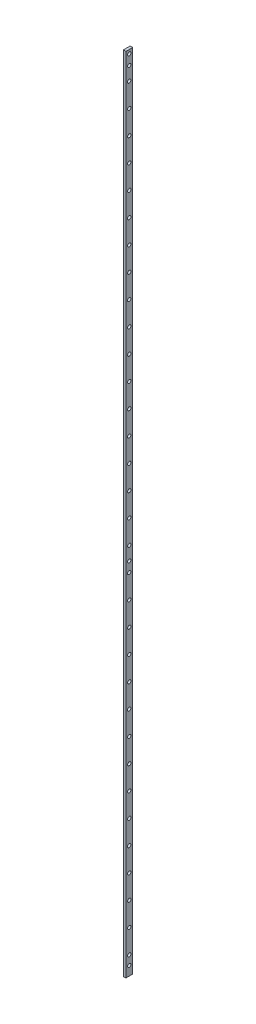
ISO-10303-21;
HEADER;
FILE_DESCRIPTION(('STEP AP214'),'2;1');
FILE_NAME('part.step','',(''),(''),'','','');
FILE_SCHEMA(('AUTOMOTIVE_DESIGN { 1 0 10303 214 1 1 1 1 }'));
ENDSEC;
DATA;
#1=APPLICATION_CONTEXT('core data for automotive mechanical design processes');
#2=APPLICATION_PROTOCOL_DEFINITION('international standard','automotive_design',2000,#1);
#3=PRODUCT_CONTEXT('',#1,'mechanical');
#4=PRODUCT('Part','Part','',(#3));
#5=PRODUCT_RELATED_PRODUCT_CATEGORY('part','',(#4));
#6=PRODUCT_DEFINITION_FORMATION('','',#4);
#7=PRODUCT_DEFINITION_CONTEXT('part definition',#1,'design');
#8=PRODUCT_DEFINITION('design','',#6,#7);
#9=PRODUCT_DEFINITION_SHAPE('','',#8);
#10=(LENGTH_UNIT() NAMED_UNIT(*) SI_UNIT(.MILLI.,.METRE.));
#11=(NAMED_UNIT(*) PLANE_ANGLE_UNIT() SI_UNIT($,.RADIAN.));
#12=(NAMED_UNIT(*) SI_UNIT($,.STERADIAN.) SOLID_ANGLE_UNIT());
#13=UNCERTAINTY_MEASURE_WITH_UNIT(LENGTH_MEASURE(1.E-05),#10,'distance_accuracy_value','');
#14=(GEOMETRIC_REPRESENTATION_CONTEXT(3) GLOBAL_UNCERTAINTY_ASSIGNED_CONTEXT((#13)) GLOBAL_UNIT_ASSIGNED_CONTEXT((#10,
#11,#12)) REPRESENTATION_CONTEXT('',''));
#15=CARTESIAN_POINT('',(0.,0.,0.));
#16=DIRECTION('',(0.,0.,1.));
#17=DIRECTION('',(1.,0.,0.));
#18=AXIS2_PLACEMENT_3D('',#15,#16,#17);
#19=CARTESIAN_POINT('',(4.8,0.,-12.7));
#20=DIRECTION('',(0.,1.,0.));
#21=DIRECTION('',(0.,0.,1.));
#22=AXIS2_PLACEMENT_3D('',#19,#20,#21);
#23=PLANE('',#22);
#24=DIRECTION('',(0.,0.,-1.));
#25=VECTOR('',#24,1.);
#26=CARTESIAN_POINT('',(0.,0.,-12.7));
#27=LINE('',#26,#25);
#28=CARTESIAN_POINT('',(0.,0.,0.));
#29=VERTEX_POINT('',#28);
#30=CARTESIAN_POINT('',(0.,0.,-12.7));
#31=VERTEX_POINT('',#30);
#32=EDGE_CURVE('E102',#29,#31,#27,.T.);
#33=ORIENTED_EDGE('',*,*,#32,.T.);
#34=DIRECTION('',(-1.,0.,0.));
#35=VECTOR('',#34,1.);
#36=CARTESIAN_POINT('',(4.8,0.,-12.7));
#37=LINE('',#36,#35);
#38=CARTESIAN_POINT('',(4.8,0.,-12.7));
#39=VERTEX_POINT('',#38);
#40=EDGE_CURVE('E93',#39,#31,#37,.T.);
#41=ORIENTED_EDGE('',*,*,#40,.F.);
#42=DIRECTION('',(0.,0.,-1.));
#43=VECTOR('',#42,1.);
#44=CARTESIAN_POINT('',(4.8,0.,-12.7));
#45=LINE('',#44,#43);
#46=CARTESIAN_POINT('',(4.8,0.,0.));
#47=VERTEX_POINT('',#46);
#48=EDGE_CURVE('E87',#47,#39,#45,.T.);
#49=ORIENTED_EDGE('',*,*,#48,.F.);
#50=DIRECTION('',(-1.,0.,0.));
#51=VECTOR('',#50,1.);
#52=CARTESIAN_POINT('',(4.8,0.,0.));
#53=LINE('',#52,#51);
#54=EDGE_CURVE('E98',#47,#29,#53,.T.);
#55=ORIENTED_EDGE('',*,*,#54,.T.);
#56=EDGE_LOOP('',(#33,#41,#49,#55));
#57=FACE_BOUND('',#56,.T.);
#58=ADVANCED_FACE('F33',(#57),#23,.F.);
#59=CARTESIAN_POINT('',(4.8,1500.,-12.7));
#60=DIRECTION('',(0.,0.,1.));
#61=DIRECTION('',(0.,-1.,0.));
#62=AXIS2_PLACEMENT_3D('',#59,#60,#61);
#63=PLANE('',#62);
#64=DIRECTION('',(0.,1.,0.));
#65=VECTOR('',#64,1.);
#66=CARTESIAN_POINT('',(0.,1500.,-12.7));
#67=LINE('',#66,#65);
#68=CARTESIAN_POINT('',(0.,1500.,-12.7));
#69=VERTEX_POINT('',#68);
#70=EDGE_CURVE('E92',#31,#69,#67,.T.);
#71=ORIENTED_EDGE('',*,*,#70,.T.);
#72=DIRECTION('',(-1.,0.,0.));
#73=VECTOR('',#72,1.);
#74=CARTESIAN_POINT('',(4.8,1500.,-12.7));
#75=LINE('',#74,#73);
#76=CARTESIAN_POINT('',(4.8,1500.,-12.7));
#77=VERTEX_POINT('',#76);
#78=EDGE_CURVE('E90',#77,#69,#75,.T.);
#79=ORIENTED_EDGE('',*,*,#78,.F.);
#80=DIRECTION('',(0.,1.,0.));
#81=VECTOR('',#80,1.);
#82=CARTESIAN_POINT('',(4.8,1500.,-12.7));
#83=LINE('',#82,#81);
#84=EDGE_CURVE('E81',#39,#77,#83,.T.);
#85=ORIENTED_EDGE('',*,*,#84,.F.);
#86=ORIENTED_EDGE('',*,*,#40,.T.);
#87=EDGE_LOOP('',(#71,#79,#85,#86));
#88=FACE_BOUND('',#87,.T.);
#89=ADVANCED_FACE('F91',(#88),#63,.F.);
#90=CARTESIAN_POINT('',(4.8,1500.,0.));
#91=DIRECTION('',(0.,-1.,0.));
#92=DIRECTION('',(0.,0.,-1.));
#93=AXIS2_PLACEMENT_3D('',#90,#91,#92);
#94=PLANE('',#93);
#95=DIRECTION('',(0.,0.,1.));
#96=VECTOR('',#95,1.);
#97=CARTESIAN_POINT('',(0.,1500.,0.));
#98=LINE('',#97,#96);
#99=CARTESIAN_POINT('',(0.,1500.,0.));
#100=VERTEX_POINT('',#99);
#101=EDGE_CURVE('E67',#69,#100,#98,.T.);
#102=ORIENTED_EDGE('',*,*,#101,.T.);
#103=DIRECTION('',(-1.,0.,0.));
#104=VECTOR('',#103,1.);
#105=CARTESIAN_POINT('',(4.8,1500.,0.));
#106=LINE('',#105,#104);
#107=CARTESIAN_POINT('',(4.8,1500.,0.));
#108=VERTEX_POINT('',#107);
#109=EDGE_CURVE('E94',#108,#100,#106,.T.);
#110=ORIENTED_EDGE('',*,*,#109,.F.);
#111=DIRECTION('',(0.,0.,1.));
#112=VECTOR('',#111,1.);
#113=CARTESIAN_POINT('',(4.8,1500.,0.));
#114=LINE('',#113,#112);
#115=EDGE_CURVE('E85',#77,#108,#114,.T.);
#116=ORIENTED_EDGE('',*,*,#115,.F.);
#117=ORIENTED_EDGE('',*,*,#78,.T.);
#118=EDGE_LOOP('',(#102,#110,#116,#117));
#119=FACE_BOUND('',#118,.T.);
#120=ADVANCED_FACE('F96',(#119),#94,.F.);
#121=CARTESIAN_POINT('',(4.8,0.,0.));
#122=DIRECTION('',(0.,0.,-1.));
#123=DIRECTION('',(-1.,0.,0.));
#124=AXIS2_PLACEMENT_3D('',#121,#122,#123);
#125=PLANE('',#124);
#126=DIRECTION('',(0.,-1.,0.));
#127=VECTOR('',#126,1.);
#128=CARTESIAN_POINT('',(0.,0.,0.));
#129=LINE('',#128,#127);
#130=EDGE_CURVE('E73',#100,#29,#129,.T.);
#131=ORIENTED_EDGE('',*,*,#130,.T.);
#132=ORIENTED_EDGE('',*,*,#54,.F.);
#133=DIRECTION('',(0.,-1.,0.));
#134=VECTOR('',#133,1.);
#135=CARTESIAN_POINT('',(4.8,0.,0.));
#136=LINE('',#135,#134);
#137=EDGE_CURVE('E50',#108,#47,#136,.T.);
#138=ORIENTED_EDGE('',*,*,#137,.F.);
#139=ORIENTED_EDGE('',*,*,#109,.T.);
#140=EDGE_LOOP('',(#131,#132,#138,#139));
#141=FACE_BOUND('',#140,.T.);
#142=ADVANCED_FACE('F309',(#141),#125,.F.);
#143=CARTESIAN_POINT('',(4.8,0.,0.));
#144=DIRECTION('',(-1.,0.,0.));
#145=DIRECTION('',(0.,0.,1.));
#146=AXIS2_PLACEMENT_3D('',#143,#144,#145);
#147=PLANE('',#146);
#148=CARTESIAN_POINT('',(4.8,672.,-6.35));
#149=DIRECTION('',(1.,0.,0.));
#150=DIRECTION('',(0.,0.,-1.));
#151=AXIS2_PLACEMENT_3D('',#148,#149,#150);
#152=CIRCLE('',#151,3.15000000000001);
#153=CARTESIAN_POINT('',(4.8,672.,-9.50000000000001));
#154=VERTEX_POINT('',#153);
#155=EDGE_CURVE('E759',#154,#154,#152,.T.);
#156=ORIENTED_EDGE('',*,*,#155,.F.);
#157=EDGE_LOOP('',(#156));
#158=FACE_BOUND('',#157,.T.);
#159=CARTESIAN_POINT('',(4.8,17.15,-6.35));
#160=DIRECTION('',(1.,0.,0.));
#161=DIRECTION('',(0.,0.,-1.));
#162=AXIS2_PLACEMENT_3D('',#159,#160,#161);
#163=CIRCLE('',#162,3.15);
#164=CARTESIAN_POINT('',(4.8,17.15,-9.5));
#165=VERTEX_POINT('',#164);
#166=EDGE_CURVE('E753',#165,#165,#163,.T.);
#167=ORIENTED_EDGE('',*,*,#166,.F.);
#168=EDGE_LOOP('',(#167));
#169=FACE_BOUND('',#168,.T.);
#170=CARTESIAN_POINT('',(4.8,1474.,-6.35));
#171=DIRECTION('',(1.,0.,0.));
#172=DIRECTION('',(0.,0.,-1.));
#173=AXIS2_PLACEMENT_3D('',#170,#171,#172);
#174=CIRCLE('',#173,3.14999999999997);
#175=CARTESIAN_POINT('',(4.8,1474.,-9.49999999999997));
#176=VERTEX_POINT('',#175);
#177=EDGE_CURVE('E747',#176,#176,#174,.T.);
#178=ORIENTED_EDGE('',*,*,#177,.F.);
#179=EDGE_LOOP('',(#178));
#180=FACE_BOUND('',#179,.T.);
#181=CARTESIAN_POINT('',(4.8,78.5,-6.35000000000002));
#182=DIRECTION('',(1.,0.,0.));
#183=DIRECTION('',(0.,0.,-1.));
#184=AXIS2_PLACEMENT_3D('',#181,#182,#183);
#185=CIRCLE('',#184,3.15);
#186=CARTESIAN_POINT('',(4.8,78.5,-9.50000000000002));
#187=VERTEX_POINT('',#186);
#188=EDGE_CURVE('E737',#187,#187,#185,.T.);
#189=ORIENTED_EDGE('',*,*,#188,.F.);
#190=EDGE_LOOP('',(#189));
#191=FACE_BOUND('',#190,.T.);
#192=CARTESIAN_POINT('',(4.8,34.3,-6.35000000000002));
#193=DIRECTION('',(1.,0.,0.));
#194=DIRECTION('',(0.,0.,-1.));
#195=AXIS2_PLACEMENT_3D('',#192,#193,#194);
#196=CIRCLE('',#195,3.15);
#197=CARTESIAN_POINT('',(4.8,34.3,-9.50000000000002));
#198=VERTEX_POINT('',#197);
#199=EDGE_CURVE('E735',#198,#198,#196,.T.);
#200=ORIENTED_EDGE('',*,*,#199,.F.);
#201=EDGE_LOOP('',(#200));
#202=FACE_BOUND('',#201,.T.);
#203=ORIENTED_EDGE('',*,*,#48,.T.);
#204=ORIENTED_EDGE('',*,*,#84,.T.);
#205=ORIENTED_EDGE('',*,*,#115,.T.);
#206=ORIENTED_EDGE('',*,*,#137,.T.);
#207=EDGE_LOOP('',(#203,#204,#205,#206));
#208=FACE_BOUND('',#207,.T.);
#209=CARTESIAN_POINT('',(4.8,122.7,-6.35000000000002));
#210=DIRECTION('',(1.,0.,0.));
#211=DIRECTION('',(0.,0.,-1.));
#212=AXIS2_PLACEMENT_3D('',#209,#210,#211);
#213=CIRCLE('',#212,3.15);
#214=CARTESIAN_POINT('',(4.8,122.7,-9.50000000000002));
#215=VERTEX_POINT('',#214);
#216=EDGE_CURVE('E115',#215,#215,#213,.T.);
#217=ORIENTED_EDGE('',*,*,#216,.F.);
#218=EDGE_LOOP('',(#217));
#219=FACE_BOUND('',#218,.T.);
#220=CARTESIAN_POINT('',(4.8,166.9,-6.35000000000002));
#221=DIRECTION('',(1.,0.,0.));
#222=DIRECTION('',(0.,0.,-1.));
#223=AXIS2_PLACEMENT_3D('',#220,#221,#222);
#224=CIRCLE('',#223,3.15);
#225=CARTESIAN_POINT('',(4.8,166.9,-9.50000000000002));
#226=VERTEX_POINT('',#225);
#227=EDGE_CURVE('E121',#226,#226,#224,.T.);
#228=ORIENTED_EDGE('',*,*,#227,.F.);
#229=EDGE_LOOP('',(#228));
#230=FACE_BOUND('',#229,.T.);
#231=CARTESIAN_POINT('',(4.8,211.1,-6.35000000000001));
#232=DIRECTION('',(1.,0.,0.));
#233=DIRECTION('',(0.,0.,-1.));
#234=AXIS2_PLACEMENT_3D('',#231,#232,#233);
#235=CIRCLE('',#234,3.15);
#236=CARTESIAN_POINT('',(4.8,211.1,-9.50000000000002));
#237=VERTEX_POINT('',#236);
#238=EDGE_CURVE('E127',#237,#237,#235,.T.);
#239=ORIENTED_EDGE('',*,*,#238,.F.);
#240=EDGE_LOOP('',(#239));
#241=FACE_BOUND('',#240,.T.);
#242=CARTESIAN_POINT('',(4.8,255.3,-6.35000000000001));
#243=DIRECTION('',(1.,0.,0.));
#244=DIRECTION('',(0.,0.,-1.));
#245=AXIS2_PLACEMENT_3D('',#242,#243,#244);
#246=CIRCLE('',#245,3.15);
#247=CARTESIAN_POINT('',(4.8,255.3,-9.50000000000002));
#248=VERTEX_POINT('',#247);
#249=EDGE_CURVE('E133',#248,#248,#246,.T.);
#250=ORIENTED_EDGE('',*,*,#249,.F.);
#251=EDGE_LOOP('',(#250));
#252=FACE_BOUND('',#251,.T.);
#253=CARTESIAN_POINT('',(4.8,299.5,-6.35000000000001));
#254=DIRECTION('',(1.,0.,0.));
#255=DIRECTION('',(0.,0.,-1.));
#256=AXIS2_PLACEMENT_3D('',#253,#254,#255);
#257=CIRCLE('',#256,3.15);
#258=CARTESIAN_POINT('',(4.8,299.5,-9.50000000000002));
#259=VERTEX_POINT('',#258);
#260=EDGE_CURVE('E139',#259,#259,#257,.T.);
#261=ORIENTED_EDGE('',*,*,#260,.F.);
#262=EDGE_LOOP('',(#261));
#263=FACE_BOUND('',#262,.T.);
#264=CARTESIAN_POINT('',(4.8,343.7,-6.35000000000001));
#265=DIRECTION('',(1.,0.,0.));
#266=DIRECTION('',(0.,0.,-1.));
#267=AXIS2_PLACEMENT_3D('',#264,#265,#266);
#268=CIRCLE('',#267,3.15);
#269=CARTESIAN_POINT('',(4.8,343.7,-9.50000000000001));
#270=VERTEX_POINT('',#269);
#271=EDGE_CURVE('E145',#270,#270,#268,.T.);
#272=ORIENTED_EDGE('',*,*,#271,.F.);
#273=EDGE_LOOP('',(#272));
#274=FACE_BOUND('',#273,.T.);
#275=CARTESIAN_POINT('',(4.8,387.9,-6.35000000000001));
#276=DIRECTION('',(1.,0.,0.));
#277=DIRECTION('',(0.,0.,-1.));
#278=AXIS2_PLACEMENT_3D('',#275,#276,#277);
#279=CIRCLE('',#278,3.15);
#280=CARTESIAN_POINT('',(4.8,387.9,-9.50000000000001));
#281=VERTEX_POINT('',#280);
#282=EDGE_CURVE('E151',#281,#281,#279,.T.);
#283=ORIENTED_EDGE('',*,*,#282,.F.);
#284=EDGE_LOOP('',(#283));
#285=FACE_BOUND('',#284,.T.);
#286=CARTESIAN_POINT('',(4.8,432.1,-6.35000000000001));
#287=DIRECTION('',(1.,0.,0.));
#288=DIRECTION('',(0.,0.,-1.));
#289=AXIS2_PLACEMENT_3D('',#286,#287,#288);
#290=CIRCLE('',#289,3.15);
#291=CARTESIAN_POINT('',(4.8,432.1,-9.50000000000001));
#292=VERTEX_POINT('',#291);
#293=EDGE_CURVE('E157',#292,#292,#290,.T.);
#294=ORIENTED_EDGE('',*,*,#293,.F.);
#295=EDGE_LOOP('',(#294));
#296=FACE_BOUND('',#295,.T.);
#297=CARTESIAN_POINT('',(4.8,476.3,-6.35000000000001));
#298=DIRECTION('',(1.,0.,0.));
#299=DIRECTION('',(0.,0.,-1.));
#300=AXIS2_PLACEMENT_3D('',#297,#298,#299);
#301=CIRCLE('',#300,3.15);
#302=CARTESIAN_POINT('',(4.8,476.3,-9.50000000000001));
#303=VERTEX_POINT('',#302);
#304=EDGE_CURVE('E163',#303,#303,#301,.T.);
#305=ORIENTED_EDGE('',*,*,#304,.F.);
#306=EDGE_LOOP('',(#305));
#307=FACE_BOUND('',#306,.T.);
#308=CARTESIAN_POINT('',(4.8,520.5,-6.35000000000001));
#309=DIRECTION('',(1.,0.,0.));
#310=DIRECTION('',(0.,0.,-1.));
#311=AXIS2_PLACEMENT_3D('',#308,#309,#310);
#312=CIRCLE('',#311,3.15);
#313=CARTESIAN_POINT('',(4.8,520.5,-9.50000000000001));
#314=VERTEX_POINT('',#313);
#315=EDGE_CURVE('E169',#314,#314,#312,.T.);
#316=ORIENTED_EDGE('',*,*,#315,.F.);
#317=EDGE_LOOP('',(#316));
#318=FACE_BOUND('',#317,.T.);
#319=CARTESIAN_POINT('',(4.8,564.7,-6.35000000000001));
#320=DIRECTION('',(1.,0.,0.));
#321=DIRECTION('',(0.,0.,-1.));
#322=AXIS2_PLACEMENT_3D('',#319,#320,#321);
#323=CIRCLE('',#322,3.15);
#324=CARTESIAN_POINT('',(4.8,564.7,-9.50000000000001));
#325=VERTEX_POINT('',#324);
#326=EDGE_CURVE('E175',#325,#325,#323,.T.);
#327=ORIENTED_EDGE('',*,*,#326,.F.);
#328=EDGE_LOOP('',(#327));
#329=FACE_BOUND('',#328,.T.);
#330=CARTESIAN_POINT('',(4.8,608.9,-6.35000000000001));
#331=DIRECTION('',(1.,0.,0.));
#332=DIRECTION('',(0.,0.,-1.));
#333=AXIS2_PLACEMENT_3D('',#330,#331,#332);
#334=CIRCLE('',#333,3.15);
#335=CARTESIAN_POINT('',(4.8,608.9,-9.50000000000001));
#336=VERTEX_POINT('',#335);
#337=EDGE_CURVE('E181',#336,#336,#334,.T.);
#338=ORIENTED_EDGE('',*,*,#337,.F.);
#339=EDGE_LOOP('',(#338));
#340=FACE_BOUND('',#339,.T.);
#341=CARTESIAN_POINT('',(4.8,653.1,-6.35000000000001));
#342=DIRECTION('',(1.,0.,0.));
#343=DIRECTION('',(0.,0.,-1.));
#344=AXIS2_PLACEMENT_3D('',#341,#342,#343);
#345=CIRCLE('',#344,3.15);
#346=CARTESIAN_POINT('',(4.8,653.1,-9.50000000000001));
#347=VERTEX_POINT('',#346);
#348=EDGE_CURVE('E187',#347,#347,#345,.T.);
#349=ORIENTED_EDGE('',*,*,#348,.F.);
#350=EDGE_LOOP('',(#349));
#351=FACE_BOUND('',#350,.T.);
#352=CARTESIAN_POINT('',(4.8,697.3,-6.35000000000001));
#353=DIRECTION('',(1.,0.,0.));
#354=DIRECTION('',(0.,0.,-1.));
#355=AXIS2_PLACEMENT_3D('',#352,#353,#354);
#356=CIRCLE('',#355,3.15);
#357=CARTESIAN_POINT('',(4.8,697.3,-9.50000000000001));
#358=VERTEX_POINT('',#357);
#359=EDGE_CURVE('E193',#358,#358,#356,.T.);
#360=ORIENTED_EDGE('',*,*,#359,.F.);
#361=EDGE_LOOP('',(#360));
#362=FACE_BOUND('',#361,.T.);
#363=CARTESIAN_POINT('',(4.8,741.5,-6.35000000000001));
#364=DIRECTION('',(1.,0.,0.));
#365=DIRECTION('',(0.,0.,-1.));
#366=AXIS2_PLACEMENT_3D('',#363,#364,#365);
#367=CIRCLE('',#366,3.15);
#368=CARTESIAN_POINT('',(4.8,741.5,-9.50000000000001));
#369=VERTEX_POINT('',#368);
#370=EDGE_CURVE('E199',#369,#369,#367,.T.);
#371=ORIENTED_EDGE('',*,*,#370,.F.);
#372=EDGE_LOOP('',(#371));
#373=FACE_BOUND('',#372,.T.);
#374=CARTESIAN_POINT('',(4.8,785.7,-6.35000000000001));
#375=DIRECTION('',(1.,0.,0.));
#376=DIRECTION('',(0.,0.,-1.));
#377=AXIS2_PLACEMENT_3D('',#374,#375,#376);
#378=CIRCLE('',#377,3.15);
#379=CARTESIAN_POINT('',(4.8,785.7,-9.50000000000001));
#380=VERTEX_POINT('',#379);
#381=EDGE_CURVE('E205',#380,#380,#378,.T.);
#382=ORIENTED_EDGE('',*,*,#381,.F.);
#383=EDGE_LOOP('',(#382));
#384=FACE_BOUND('',#383,.T.);
#385=CARTESIAN_POINT('',(4.8,829.9,-6.35000000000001));
#386=DIRECTION('',(1.,0.,0.));
#387=DIRECTION('',(0.,0.,-1.));
#388=AXIS2_PLACEMENT_3D('',#385,#386,#387);
#389=CIRCLE('',#388,3.15);
#390=CARTESIAN_POINT('',(4.8,829.9,-9.50000000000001));
#391=VERTEX_POINT('',#390);
#392=EDGE_CURVE('E211',#391,#391,#389,.T.);
#393=ORIENTED_EDGE('',*,*,#392,.F.);
#394=EDGE_LOOP('',(#393));
#395=FACE_BOUND('',#394,.T.);
#396=CARTESIAN_POINT('',(4.8,874.1,-6.35000000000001));
#397=DIRECTION('',(1.,0.,0.));
#398=DIRECTION('',(0.,0.,-1.));
#399=AXIS2_PLACEMENT_3D('',#396,#397,#398);
#400=CIRCLE('',#399,3.15);
#401=CARTESIAN_POINT('',(4.8,874.1,-9.50000000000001));
#402=VERTEX_POINT('',#401);
#403=EDGE_CURVE('E217',#402,#402,#400,.T.);
#404=ORIENTED_EDGE('',*,*,#403,.F.);
#405=EDGE_LOOP('',(#404));
#406=FACE_BOUND('',#405,.T.);
#407=CARTESIAN_POINT('',(4.8,918.3,-6.35000000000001));
#408=DIRECTION('',(1.,0.,0.));
#409=DIRECTION('',(0.,0.,-1.));
#410=AXIS2_PLACEMENT_3D('',#407,#408,#409);
#411=CIRCLE('',#410,3.15);
#412=CARTESIAN_POINT('',(4.8,918.3,-9.50000000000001));
#413=VERTEX_POINT('',#412);
#414=EDGE_CURVE('E223',#413,#413,#411,.T.);
#415=ORIENTED_EDGE('',*,*,#414,.F.);
#416=EDGE_LOOP('',(#415));
#417=FACE_BOUND('',#416,.T.);
#418=CARTESIAN_POINT('',(4.8,962.5,-6.35000000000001));
#419=DIRECTION('',(1.,0.,0.));
#420=DIRECTION('',(0.,0.,-1.));
#421=AXIS2_PLACEMENT_3D('',#418,#419,#420);
#422=CIRCLE('',#421,3.15);
#423=CARTESIAN_POINT('',(4.8,962.5,-9.50000000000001));
#424=VERTEX_POINT('',#423);
#425=EDGE_CURVE('E229',#424,#424,#422,.T.);
#426=ORIENTED_EDGE('',*,*,#425,.F.);
#427=EDGE_LOOP('',(#426));
#428=FACE_BOUND('',#427,.T.);
#429=CARTESIAN_POINT('',(4.8,1006.7,-6.35000000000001));
#430=DIRECTION('',(1.,0.,0.));
#431=DIRECTION('',(0.,0.,-1.));
#432=AXIS2_PLACEMENT_3D('',#429,#430,#431);
#433=CIRCLE('',#432,3.15);
#434=CARTESIAN_POINT('',(4.8,1006.7,-9.50000000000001));
#435=VERTEX_POINT('',#434);
#436=EDGE_CURVE('E235',#435,#435,#433,.T.);
#437=ORIENTED_EDGE('',*,*,#436,.F.);
#438=EDGE_LOOP('',(#437));
#439=FACE_BOUND('',#438,.T.);
#440=CARTESIAN_POINT('',(4.8,1050.9,-6.35));
#441=DIRECTION('',(1.,0.,0.));
#442=DIRECTION('',(0.,0.,-1.));
#443=AXIS2_PLACEMENT_3D('',#440,#441,#442);
#444=CIRCLE('',#443,3.15);
#445=CARTESIAN_POINT('',(4.8,1050.9,-9.50000000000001));
#446=VERTEX_POINT('',#445);
#447=EDGE_CURVE('E241',#446,#446,#444,.T.);
#448=ORIENTED_EDGE('',*,*,#447,.F.);
#449=EDGE_LOOP('',(#448));
#450=FACE_BOUND('',#449,.T.);
#451=CARTESIAN_POINT('',(4.8,1095.1,-6.35));
#452=DIRECTION('',(1.,0.,0.));
#453=DIRECTION('',(0.,0.,-1.));
#454=AXIS2_PLACEMENT_3D('',#451,#452,#453);
#455=CIRCLE('',#454,3.15);
#456=CARTESIAN_POINT('',(4.8,1095.1,-9.50000000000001));
#457=VERTEX_POINT('',#456);
#458=EDGE_CURVE('E247',#457,#457,#455,.T.);
#459=ORIENTED_EDGE('',*,*,#458,.F.);
#460=EDGE_LOOP('',(#459));
#461=FACE_BOUND('',#460,.T.);
#462=CARTESIAN_POINT('',(4.8,1139.3,-6.35));
#463=DIRECTION('',(1.,0.,0.));
#464=DIRECTION('',(0.,0.,-1.));
#465=AXIS2_PLACEMENT_3D('',#462,#463,#464);
#466=CIRCLE('',#465,3.15);
#467=CARTESIAN_POINT('',(4.8,1139.3,-9.50000000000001));
#468=VERTEX_POINT('',#467);
#469=EDGE_CURVE('E253',#468,#468,#466,.T.);
#470=ORIENTED_EDGE('',*,*,#469,.F.);
#471=EDGE_LOOP('',(#470));
#472=FACE_BOUND('',#471,.T.);
#473=CARTESIAN_POINT('',(4.8,1183.5,-6.35));
#474=DIRECTION('',(1.,0.,0.));
#475=DIRECTION('',(0.,0.,-1.));
#476=AXIS2_PLACEMENT_3D('',#473,#474,#475);
#477=CIRCLE('',#476,3.15);
#478=CARTESIAN_POINT('',(4.8,1183.5,-9.50000000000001));
#479=VERTEX_POINT('',#478);
#480=EDGE_CURVE('E259',#479,#479,#477,.T.);
#481=ORIENTED_EDGE('',*,*,#480,.F.);
#482=EDGE_LOOP('',(#481));
#483=FACE_BOUND('',#482,.T.);
#484=CARTESIAN_POINT('',(4.8,1227.7,-6.35));
#485=DIRECTION('',(1.,0.,0.));
#486=DIRECTION('',(0.,0.,-1.));
#487=AXIS2_PLACEMENT_3D('',#484,#485,#486);
#488=CIRCLE('',#487,3.15);
#489=CARTESIAN_POINT('',(4.8,1227.7,-9.50000000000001));
#490=VERTEX_POINT('',#489);
#491=EDGE_CURVE('E265',#490,#490,#488,.T.);
#492=ORIENTED_EDGE('',*,*,#491,.F.);
#493=EDGE_LOOP('',(#492));
#494=FACE_BOUND('',#493,.T.);
#495=CARTESIAN_POINT('',(4.8,1271.9,-6.35));
#496=DIRECTION('',(1.,0.,0.));
#497=DIRECTION('',(0.,0.,-1.));
#498=AXIS2_PLACEMENT_3D('',#495,#496,#497);
#499=CIRCLE('',#498,3.15);
#500=CARTESIAN_POINT('',(4.8,1271.9,-9.5));
#501=VERTEX_POINT('',#500);
#502=EDGE_CURVE('E271',#501,#501,#499,.T.);
#503=ORIENTED_EDGE('',*,*,#502,.F.);
#504=EDGE_LOOP('',(#503));
#505=FACE_BOUND('',#504,.T.);
#506=CARTESIAN_POINT('',(4.8,1316.1,-6.35));
#507=DIRECTION('',(1.,0.,0.));
#508=DIRECTION('',(0.,0.,-1.));
#509=AXIS2_PLACEMENT_3D('',#506,#507,#508);
#510=CIRCLE('',#509,3.15);
#511=CARTESIAN_POINT('',(4.8,1316.1,-9.5));
#512=VERTEX_POINT('',#511);
#513=EDGE_CURVE('E277',#512,#512,#510,.T.);
#514=ORIENTED_EDGE('',*,*,#513,.F.);
#515=EDGE_LOOP('',(#514));
#516=FACE_BOUND('',#515,.T.);
#517=CARTESIAN_POINT('',(4.8,1360.3,-6.35));
#518=DIRECTION('',(1.,0.,0.));
#519=DIRECTION('',(0.,0.,-1.));
#520=AXIS2_PLACEMENT_3D('',#517,#518,#519);
#521=CIRCLE('',#520,3.15);
#522=CARTESIAN_POINT('',(4.8,1360.3,-9.5));
#523=VERTEX_POINT('',#522);
#524=EDGE_CURVE('E283',#523,#523,#521,.T.);
#525=ORIENTED_EDGE('',*,*,#524,.F.);
#526=EDGE_LOOP('',(#525));
#527=FACE_BOUND('',#526,.T.);
#528=CARTESIAN_POINT('',(4.8,1404.5,-6.35));
#529=DIRECTION('',(1.,0.,0.));
#530=DIRECTION('',(0.,0.,-1.));
#531=AXIS2_PLACEMENT_3D('',#528,#529,#530);
#532=CIRCLE('',#531,3.15);
#533=CARTESIAN_POINT('',(4.8,1404.5,-9.5));
#534=VERTEX_POINT('',#533);
#535=EDGE_CURVE('E289',#534,#534,#532,.T.);
#536=ORIENTED_EDGE('',*,*,#535,.F.);
#537=EDGE_LOOP('',(#536));
#538=FACE_BOUND('',#537,.T.);
#539=CARTESIAN_POINT('',(4.8,1448.7,-6.35));
#540=DIRECTION('',(1.,0.,0.));
#541=DIRECTION('',(0.,0.,-1.));
#542=AXIS2_PLACEMENT_3D('',#539,#540,#541);
#543=CIRCLE('',#542,3.15);
#544=CARTESIAN_POINT('',(4.8,1448.7,-9.5));
#545=VERTEX_POINT('',#544);
#546=EDGE_CURVE('E295',#545,#545,#543,.T.);
#547=ORIENTED_EDGE('',*,*,#546,.F.);
#548=EDGE_LOOP('',(#547));
#549=FACE_BOUND('',#548,.T.);
#550=CARTESIAN_POINT('',(4.8,1492.9,-6.35));
#551=DIRECTION('',(1.,0.,0.));
#552=DIRECTION('',(0.,0.,-1.));
#553=AXIS2_PLACEMENT_3D('',#550,#551,#552);
#554=CIRCLE('',#553,3.15);
#555=CARTESIAN_POINT('',(4.8,1492.9,-9.5));
#556=VERTEX_POINT('',#555);
#557=EDGE_CURVE('E11',#556,#556,#554,.T.);
#558=ORIENTED_EDGE('',*,*,#557,.F.);
#559=EDGE_LOOP('',(#558));
#560=FACE_BOUND('',#559,.T.);
#561=ADVANCED_FACE('F82',(#158,#169,#180,#191,#202,#208,#219,#230,#241,#252,#263,#274,#285,#296,
#307,#318,#329,#340,#351,#362,#373,#384,#395,#406,#417,#428,#439,#450,#461,#472,#483,#494,#505,
#516,#527,#538,#549,#560),#147,.F.);
#562=CARTESIAN_POINT('',(0.,0.,0.));
#563=DIRECTION('',(-1.,0.,0.));
#564=DIRECTION('',(0.,0.,1.));
#565=AXIS2_PLACEMENT_3D('',#562,#563,#564);
#566=PLANE('',#565);
#567=CARTESIAN_POINT('',(0.,672.,-6.35));
#568=DIRECTION('',(1.,0.,0.));
#569=DIRECTION('',(0.,0.,-1.));
#570=AXIS2_PLACEMENT_3D('',#567,#568,#569);
#571=CIRCLE('',#570,3.15000000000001);
#572=CARTESIAN_POINT('',(0.,672.,-9.50000000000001));
#573=VERTEX_POINT('',#572);
#574=EDGE_CURVE('E756',#573,#573,#571,.T.);
#575=ORIENTED_EDGE('',*,*,#574,.T.);
#576=EDGE_LOOP('',(#575));
#577=FACE_BOUND('',#576,.T.);
#578=CARTESIAN_POINT('',(0.,17.15,-6.35));
#579=DIRECTION('',(1.,0.,0.));
#580=DIRECTION('',(0.,0.,-1.));
#581=AXIS2_PLACEMENT_3D('',#578,#579,#580);
#582=CIRCLE('',#581,3.15);
#583=CARTESIAN_POINT('',(0.,17.15,-9.5));
#584=VERTEX_POINT('',#583);
#585=EDGE_CURVE('E750',#584,#584,#582,.T.);
#586=ORIENTED_EDGE('',*,*,#585,.T.);
#587=EDGE_LOOP('',(#586));
#588=FACE_BOUND('',#587,.T.);
#589=CARTESIAN_POINT('',(0.,1474.,-6.35));
#590=DIRECTION('',(1.,0.,0.));
#591=DIRECTION('',(0.,0.,-1.));
#592=AXIS2_PLACEMENT_3D('',#589,#590,#591);
#593=CIRCLE('',#592,3.14999999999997);
#594=CARTESIAN_POINT('',(0.,1474.,-9.49999999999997));
#595=VERTEX_POINT('',#594);
#596=EDGE_CURVE('E746',#595,#595,#593,.T.);
#597=ORIENTED_EDGE('',*,*,#596,.T.);
#598=EDGE_LOOP('',(#597));
#599=FACE_BOUND('',#598,.T.);
#600=CARTESIAN_POINT('',(0.,78.5,-6.35000000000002));
#601=DIRECTION('',(1.,0.,0.));
#602=DIRECTION('',(0.,0.,-1.));
#603=AXIS2_PLACEMENT_3D('',#600,#601,#602);
#604=CIRCLE('',#603,3.15);
#605=CARTESIAN_POINT('',(0.,78.5,-9.50000000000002));
#606=VERTEX_POINT('',#605);
#607=EDGE_CURVE('E741',#606,#606,#604,.T.);
#608=ORIENTED_EDGE('',*,*,#607,.T.);
#609=EDGE_LOOP('',(#608));
#610=FACE_BOUND('',#609,.T.);
#611=CARTESIAN_POINT('',(0.,34.3,-6.35000000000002));
#612=DIRECTION('',(1.,0.,0.));
#613=DIRECTION('',(0.,0.,-1.));
#614=AXIS2_PLACEMENT_3D('',#611,#612,#613);
#615=CIRCLE('',#614,3.15);
#616=CARTESIAN_POINT('',(0.,34.3,-9.50000000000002));
#617=VERTEX_POINT('',#616);
#618=EDGE_CURVE('E105',#617,#617,#615,.T.);
#619=ORIENTED_EDGE('',*,*,#618,.T.);
#620=EDGE_LOOP('',(#619));
#621=FACE_BOUND('',#620,.T.);
#622=ORIENTED_EDGE('',*,*,#32,.F.);
#623=ORIENTED_EDGE('',*,*,#130,.F.);
#624=ORIENTED_EDGE('',*,*,#101,.F.);
#625=ORIENTED_EDGE('',*,*,#70,.F.);
#626=EDGE_LOOP('',(#622,#623,#624,#625));
#627=FACE_BOUND('',#626,.T.);
#628=CARTESIAN_POINT('',(0.,122.7,-6.35000000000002));
#629=DIRECTION('',(1.,0.,0.));
#630=DIRECTION('',(0.,0.,-1.));
#631=AXIS2_PLACEMENT_3D('',#628,#629,#630);
#632=CIRCLE('',#631,3.15);
#633=CARTESIAN_POINT('',(0.,122.7,-9.50000000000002));
#634=VERTEX_POINT('',#633);
#635=EDGE_CURVE('E112',#634,#634,#632,.T.);
#636=ORIENTED_EDGE('',*,*,#635,.T.);
#637=EDGE_LOOP('',(#636));
#638=FACE_BOUND('',#637,.T.);
#639=CARTESIAN_POINT('',(0.,166.9,-6.35000000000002));
#640=DIRECTION('',(1.,0.,0.));
#641=DIRECTION('',(0.,0.,-1.));
#642=AXIS2_PLACEMENT_3D('',#639,#640,#641);
#643=CIRCLE('',#642,3.15);
#644=CARTESIAN_POINT('',(0.,166.9,-9.50000000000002));
#645=VERTEX_POINT('',#644);
#646=EDGE_CURVE('E118',#645,#645,#643,.T.);
#647=ORIENTED_EDGE('',*,*,#646,.T.);
#648=EDGE_LOOP('',(#647));
#649=FACE_BOUND('',#648,.T.);
#650=CARTESIAN_POINT('',(0.,211.1,-6.35000000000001));
#651=DIRECTION('',(1.,0.,0.));
#652=DIRECTION('',(0.,0.,-1.));
#653=AXIS2_PLACEMENT_3D('',#650,#651,#652);
#654=CIRCLE('',#653,3.15);
#655=CARTESIAN_POINT('',(0.,211.1,-9.50000000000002));
#656=VERTEX_POINT('',#655);
#657=EDGE_CURVE('E124',#656,#656,#654,.T.);
#658=ORIENTED_EDGE('',*,*,#657,.T.);
#659=EDGE_LOOP('',(#658));
#660=FACE_BOUND('',#659,.T.);
#661=CARTESIAN_POINT('',(0.,255.3,-6.35000000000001));
#662=DIRECTION('',(1.,0.,0.));
#663=DIRECTION('',(0.,0.,-1.));
#664=AXIS2_PLACEMENT_3D('',#661,#662,#663);
#665=CIRCLE('',#664,3.15);
#666=CARTESIAN_POINT('',(0.,255.3,-9.50000000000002));
#667=VERTEX_POINT('',#666);
#668=EDGE_CURVE('E130',#667,#667,#665,.T.);
#669=ORIENTED_EDGE('',*,*,#668,.T.);
#670=EDGE_LOOP('',(#669));
#671=FACE_BOUND('',#670,.T.);
#672=CARTESIAN_POINT('',(0.,299.5,-6.35000000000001));
#673=DIRECTION('',(1.,0.,0.));
#674=DIRECTION('',(0.,0.,-1.));
#675=AXIS2_PLACEMENT_3D('',#672,#673,#674);
#676=CIRCLE('',#675,3.15);
#677=CARTESIAN_POINT('',(0.,299.5,-9.50000000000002));
#678=VERTEX_POINT('',#677);
#679=EDGE_CURVE('E136',#678,#678,#676,.T.);
#680=ORIENTED_EDGE('',*,*,#679,.T.);
#681=EDGE_LOOP('',(#680));
#682=FACE_BOUND('',#681,.T.);
#683=CARTESIAN_POINT('',(0.,343.7,-6.35000000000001));
#684=DIRECTION('',(1.,0.,0.));
#685=DIRECTION('',(0.,0.,-1.));
#686=AXIS2_PLACEMENT_3D('',#683,#684,#685);
#687=CIRCLE('',#686,3.15);
#688=CARTESIAN_POINT('',(0.,343.7,-9.50000000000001));
#689=VERTEX_POINT('',#688);
#690=EDGE_CURVE('E142',#689,#689,#687,.T.);
#691=ORIENTED_EDGE('',*,*,#690,.T.);
#692=EDGE_LOOP('',(#691));
#693=FACE_BOUND('',#692,.T.);
#694=CARTESIAN_POINT('',(0.,387.9,-6.35000000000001));
#695=DIRECTION('',(1.,0.,0.));
#696=DIRECTION('',(0.,0.,-1.));
#697=AXIS2_PLACEMENT_3D('',#694,#695,#696);
#698=CIRCLE('',#697,3.15);
#699=CARTESIAN_POINT('',(0.,387.9,-9.50000000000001));
#700=VERTEX_POINT('',#699);
#701=EDGE_CURVE('E148',#700,#700,#698,.T.);
#702=ORIENTED_EDGE('',*,*,#701,.T.);
#703=EDGE_LOOP('',(#702));
#704=FACE_BOUND('',#703,.T.);
#705=CARTESIAN_POINT('',(0.,432.1,-6.35000000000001));
#706=DIRECTION('',(1.,0.,0.));
#707=DIRECTION('',(0.,0.,-1.));
#708=AXIS2_PLACEMENT_3D('',#705,#706,#707);
#709=CIRCLE('',#708,3.15);
#710=CARTESIAN_POINT('',(0.,432.1,-9.50000000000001));
#711=VERTEX_POINT('',#710);
#712=EDGE_CURVE('E154',#711,#711,#709,.T.);
#713=ORIENTED_EDGE('',*,*,#712,.T.);
#714=EDGE_LOOP('',(#713));
#715=FACE_BOUND('',#714,.T.);
#716=CARTESIAN_POINT('',(0.,476.3,-6.35000000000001));
#717=DIRECTION('',(1.,0.,0.));
#718=DIRECTION('',(0.,0.,-1.));
#719=AXIS2_PLACEMENT_3D('',#716,#717,#718);
#720=CIRCLE('',#719,3.15);
#721=CARTESIAN_POINT('',(0.,476.3,-9.50000000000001));
#722=VERTEX_POINT('',#721);
#723=EDGE_CURVE('E160',#722,#722,#720,.T.);
#724=ORIENTED_EDGE('',*,*,#723,.T.);
#725=EDGE_LOOP('',(#724));
#726=FACE_BOUND('',#725,.T.);
#727=CARTESIAN_POINT('',(0.,520.5,-6.35000000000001));
#728=DIRECTION('',(1.,0.,0.));
#729=DIRECTION('',(0.,0.,-1.));
#730=AXIS2_PLACEMENT_3D('',#727,#728,#729);
#731=CIRCLE('',#730,3.15);
#732=CARTESIAN_POINT('',(0.,520.5,-9.50000000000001));
#733=VERTEX_POINT('',#732);
#734=EDGE_CURVE('E166',#733,#733,#731,.T.);
#735=ORIENTED_EDGE('',*,*,#734,.T.);
#736=EDGE_LOOP('',(#735));
#737=FACE_BOUND('',#736,.T.);
#738=CARTESIAN_POINT('',(0.,564.7,-6.35000000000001));
#739=DIRECTION('',(1.,0.,0.));
#740=DIRECTION('',(0.,0.,-1.));
#741=AXIS2_PLACEMENT_3D('',#738,#739,#740);
#742=CIRCLE('',#741,3.15);
#743=CARTESIAN_POINT('',(0.,564.7,-9.50000000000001));
#744=VERTEX_POINT('',#743);
#745=EDGE_CURVE('E172',#744,#744,#742,.T.);
#746=ORIENTED_EDGE('',*,*,#745,.T.);
#747=EDGE_LOOP('',(#746));
#748=FACE_BOUND('',#747,.T.);
#749=CARTESIAN_POINT('',(0.,608.9,-6.35000000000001));
#750=DIRECTION('',(1.,0.,0.));
#751=DIRECTION('',(0.,0.,-1.));
#752=AXIS2_PLACEMENT_3D('',#749,#750,#751);
#753=CIRCLE('',#752,3.15);
#754=CARTESIAN_POINT('',(0.,608.9,-9.50000000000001));
#755=VERTEX_POINT('',#754);
#756=EDGE_CURVE('E178',#755,#755,#753,.T.);
#757=ORIENTED_EDGE('',*,*,#756,.T.);
#758=EDGE_LOOP('',(#757));
#759=FACE_BOUND('',#758,.T.);
#760=CARTESIAN_POINT('',(0.,653.1,-6.35000000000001));
#761=DIRECTION('',(1.,0.,0.));
#762=DIRECTION('',(0.,0.,-1.));
#763=AXIS2_PLACEMENT_3D('',#760,#761,#762);
#764=CIRCLE('',#763,3.15);
#765=CARTESIAN_POINT('',(0.,653.1,-9.50000000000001));
#766=VERTEX_POINT('',#765);
#767=EDGE_CURVE('E184',#766,#766,#764,.T.);
#768=ORIENTED_EDGE('',*,*,#767,.T.);
#769=EDGE_LOOP('',(#768));
#770=FACE_BOUND('',#769,.T.);
#771=CARTESIAN_POINT('',(0.,697.3,-6.35000000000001));
#772=DIRECTION('',(1.,0.,0.));
#773=DIRECTION('',(0.,0.,-1.));
#774=AXIS2_PLACEMENT_3D('',#771,#772,#773);
#775=CIRCLE('',#774,3.15);
#776=CARTESIAN_POINT('',(0.,697.3,-9.50000000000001));
#777=VERTEX_POINT('',#776);
#778=EDGE_CURVE('E190',#777,#777,#775,.T.);
#779=ORIENTED_EDGE('',*,*,#778,.T.);
#780=EDGE_LOOP('',(#779));
#781=FACE_BOUND('',#780,.T.);
#782=CARTESIAN_POINT('',(0.,741.5,-6.35000000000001));
#783=DIRECTION('',(1.,0.,0.));
#784=DIRECTION('',(0.,0.,-1.));
#785=AXIS2_PLACEMENT_3D('',#782,#783,#784);
#786=CIRCLE('',#785,3.15);
#787=CARTESIAN_POINT('',(0.,741.5,-9.50000000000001));
#788=VERTEX_POINT('',#787);
#789=EDGE_CURVE('E196',#788,#788,#786,.T.);
#790=ORIENTED_EDGE('',*,*,#789,.T.);
#791=EDGE_LOOP('',(#790));
#792=FACE_BOUND('',#791,.T.);
#793=CARTESIAN_POINT('',(0.,785.7,-6.35000000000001));
#794=DIRECTION('',(1.,0.,0.));
#795=DIRECTION('',(0.,0.,-1.));
#796=AXIS2_PLACEMENT_3D('',#793,#794,#795);
#797=CIRCLE('',#796,3.15);
#798=CARTESIAN_POINT('',(0.,785.7,-9.50000000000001));
#799=VERTEX_POINT('',#798);
#800=EDGE_CURVE('E202',#799,#799,#797,.T.);
#801=ORIENTED_EDGE('',*,*,#800,.T.);
#802=EDGE_LOOP('',(#801));
#803=FACE_BOUND('',#802,.T.);
#804=CARTESIAN_POINT('',(0.,829.9,-6.35000000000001));
#805=DIRECTION('',(1.,0.,0.));
#806=DIRECTION('',(0.,0.,-1.));
#807=AXIS2_PLACEMENT_3D('',#804,#805,#806);
#808=CIRCLE('',#807,3.15);
#809=CARTESIAN_POINT('',(0.,829.9,-9.50000000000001));
#810=VERTEX_POINT('',#809);
#811=EDGE_CURVE('E208',#810,#810,#808,.T.);
#812=ORIENTED_EDGE('',*,*,#811,.T.);
#813=EDGE_LOOP('',(#812));
#814=FACE_BOUND('',#813,.T.);
#815=CARTESIAN_POINT('',(0.,874.1,-6.35000000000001));
#816=DIRECTION('',(1.,0.,0.));
#817=DIRECTION('',(0.,0.,-1.));
#818=AXIS2_PLACEMENT_3D('',#815,#816,#817);
#819=CIRCLE('',#818,3.15);
#820=CARTESIAN_POINT('',(0.,874.1,-9.50000000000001));
#821=VERTEX_POINT('',#820);
#822=EDGE_CURVE('E214',#821,#821,#819,.T.);
#823=ORIENTED_EDGE('',*,*,#822,.T.);
#824=EDGE_LOOP('',(#823));
#825=FACE_BOUND('',#824,.T.);
#826=CARTESIAN_POINT('',(0.,918.3,-6.35000000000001));
#827=DIRECTION('',(1.,0.,0.));
#828=DIRECTION('',(0.,0.,-1.));
#829=AXIS2_PLACEMENT_3D('',#826,#827,#828);
#830=CIRCLE('',#829,3.15);
#831=CARTESIAN_POINT('',(0.,918.3,-9.50000000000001));
#832=VERTEX_POINT('',#831);
#833=EDGE_CURVE('E220',#832,#832,#830,.T.);
#834=ORIENTED_EDGE('',*,*,#833,.T.);
#835=EDGE_LOOP('',(#834));
#836=FACE_BOUND('',#835,.T.);
#837=CARTESIAN_POINT('',(0.,962.5,-6.35000000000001));
#838=DIRECTION('',(1.,0.,0.));
#839=DIRECTION('',(0.,0.,-1.));
#840=AXIS2_PLACEMENT_3D('',#837,#838,#839);
#841=CIRCLE('',#840,3.15);
#842=CARTESIAN_POINT('',(0.,962.5,-9.50000000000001));
#843=VERTEX_POINT('',#842);
#844=EDGE_CURVE('E226',#843,#843,#841,.T.);
#845=ORIENTED_EDGE('',*,*,#844,.T.);
#846=EDGE_LOOP('',(#845));
#847=FACE_BOUND('',#846,.T.);
#848=CARTESIAN_POINT('',(0.,1006.7,-6.35000000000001));
#849=DIRECTION('',(1.,0.,0.));
#850=DIRECTION('',(0.,0.,-1.));
#851=AXIS2_PLACEMENT_3D('',#848,#849,#850);
#852=CIRCLE('',#851,3.15);
#853=CARTESIAN_POINT('',(0.,1006.7,-9.50000000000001));
#854=VERTEX_POINT('',#853);
#855=EDGE_CURVE('E232',#854,#854,#852,.T.);
#856=ORIENTED_EDGE('',*,*,#855,.T.);
#857=EDGE_LOOP('',(#856));
#858=FACE_BOUND('',#857,.T.);
#859=CARTESIAN_POINT('',(0.,1050.9,-6.35));
#860=DIRECTION('',(1.,0.,0.));
#861=DIRECTION('',(0.,0.,-1.));
#862=AXIS2_PLACEMENT_3D('',#859,#860,#861);
#863=CIRCLE('',#862,3.15);
#864=CARTESIAN_POINT('',(0.,1050.9,-9.50000000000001));
#865=VERTEX_POINT('',#864);
#866=EDGE_CURVE('E238',#865,#865,#863,.T.);
#867=ORIENTED_EDGE('',*,*,#866,.T.);
#868=EDGE_LOOP('',(#867));
#869=FACE_BOUND('',#868,.T.);
#870=CARTESIAN_POINT('',(0.,1095.1,-6.35));
#871=DIRECTION('',(1.,0.,0.));
#872=DIRECTION('',(0.,0.,-1.));
#873=AXIS2_PLACEMENT_3D('',#870,#871,#872);
#874=CIRCLE('',#873,3.15);
#875=CARTESIAN_POINT('',(0.,1095.1,-9.50000000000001));
#876=VERTEX_POINT('',#875);
#877=EDGE_CURVE('E244',#876,#876,#874,.T.);
#878=ORIENTED_EDGE('',*,*,#877,.T.);
#879=EDGE_LOOP('',(#878));
#880=FACE_BOUND('',#879,.T.);
#881=CARTESIAN_POINT('',(0.,1139.3,-6.35));
#882=DIRECTION('',(1.,0.,0.));
#883=DIRECTION('',(0.,0.,-1.));
#884=AXIS2_PLACEMENT_3D('',#881,#882,#883);
#885=CIRCLE('',#884,3.15);
#886=CARTESIAN_POINT('',(0.,1139.3,-9.50000000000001));
#887=VERTEX_POINT('',#886);
#888=EDGE_CURVE('E250',#887,#887,#885,.T.);
#889=ORIENTED_EDGE('',*,*,#888,.T.);
#890=EDGE_LOOP('',(#889));
#891=FACE_BOUND('',#890,.T.);
#892=CARTESIAN_POINT('',(0.,1183.5,-6.35));
#893=DIRECTION('',(1.,0.,0.));
#894=DIRECTION('',(0.,0.,-1.));
#895=AXIS2_PLACEMENT_3D('',#892,#893,#894);
#896=CIRCLE('',#895,3.15);
#897=CARTESIAN_POINT('',(0.,1183.5,-9.50000000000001));
#898=VERTEX_POINT('',#897);
#899=EDGE_CURVE('E256',#898,#898,#896,.T.);
#900=ORIENTED_EDGE('',*,*,#899,.T.);
#901=EDGE_LOOP('',(#900));
#902=FACE_BOUND('',#901,.T.);
#903=CARTESIAN_POINT('',(0.,1227.7,-6.35));
#904=DIRECTION('',(1.,0.,0.));
#905=DIRECTION('',(0.,0.,-1.));
#906=AXIS2_PLACEMENT_3D('',#903,#904,#905);
#907=CIRCLE('',#906,3.15);
#908=CARTESIAN_POINT('',(0.,1227.7,-9.50000000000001));
#909=VERTEX_POINT('',#908);
#910=EDGE_CURVE('E262',#909,#909,#907,.T.);
#911=ORIENTED_EDGE('',*,*,#910,.T.);
#912=EDGE_LOOP('',(#911));
#913=FACE_BOUND('',#912,.T.);
#914=CARTESIAN_POINT('',(0.,1271.9,-6.35));
#915=DIRECTION('',(1.,0.,0.));
#916=DIRECTION('',(0.,0.,-1.));
#917=AXIS2_PLACEMENT_3D('',#914,#915,#916);
#918=CIRCLE('',#917,3.15);
#919=CARTESIAN_POINT('',(0.,1271.9,-9.5));
#920=VERTEX_POINT('',#919);
#921=EDGE_CURVE('E268',#920,#920,#918,.T.);
#922=ORIENTED_EDGE('',*,*,#921,.T.);
#923=EDGE_LOOP('',(#922));
#924=FACE_BOUND('',#923,.T.);
#925=CARTESIAN_POINT('',(0.,1316.1,-6.35));
#926=DIRECTION('',(1.,0.,0.));
#927=DIRECTION('',(0.,0.,-1.));
#928=AXIS2_PLACEMENT_3D('',#925,#926,#927);
#929=CIRCLE('',#928,3.15);
#930=CARTESIAN_POINT('',(0.,1316.1,-9.5));
#931=VERTEX_POINT('',#930);
#932=EDGE_CURVE('E274',#931,#931,#929,.T.);
#933=ORIENTED_EDGE('',*,*,#932,.T.);
#934=EDGE_LOOP('',(#933));
#935=FACE_BOUND('',#934,.T.);
#936=CARTESIAN_POINT('',(0.,1360.3,-6.35));
#937=DIRECTION('',(1.,0.,0.));
#938=DIRECTION('',(0.,0.,-1.));
#939=AXIS2_PLACEMENT_3D('',#936,#937,#938);
#940=CIRCLE('',#939,3.15);
#941=CARTESIAN_POINT('',(0.,1360.3,-9.5));
#942=VERTEX_POINT('',#941);
#943=EDGE_CURVE('E280',#942,#942,#940,.T.);
#944=ORIENTED_EDGE('',*,*,#943,.T.);
#945=EDGE_LOOP('',(#944));
#946=FACE_BOUND('',#945,.T.);
#947=CARTESIAN_POINT('',(0.,1404.5,-6.35));
#948=DIRECTION('',(1.,0.,0.));
#949=DIRECTION('',(0.,0.,-1.));
#950=AXIS2_PLACEMENT_3D('',#947,#948,#949);
#951=CIRCLE('',#950,3.15);
#952=CARTESIAN_POINT('',(0.,1404.5,-9.5));
#953=VERTEX_POINT('',#952);
#954=EDGE_CURVE('E286',#953,#953,#951,.T.);
#955=ORIENTED_EDGE('',*,*,#954,.T.);
#956=EDGE_LOOP('',(#955));
#957=FACE_BOUND('',#956,.T.);
#958=CARTESIAN_POINT('',(0.,1448.7,-6.35));
#959=DIRECTION('',(1.,0.,0.));
#960=DIRECTION('',(0.,0.,-1.));
#961=AXIS2_PLACEMENT_3D('',#958,#959,#960);
#962=CIRCLE('',#961,3.15);
#963=CARTESIAN_POINT('',(0.,1448.7,-9.5));
#964=VERTEX_POINT('',#963);
#965=EDGE_CURVE('E292',#964,#964,#962,.T.);
#966=ORIENTED_EDGE('',*,*,#965,.T.);
#967=EDGE_LOOP('',(#966));
#968=FACE_BOUND('',#967,.T.);
#969=CARTESIAN_POINT('',(0.,1492.9,-6.35));
#970=DIRECTION('',(1.,0.,0.));
#971=DIRECTION('',(0.,0.,-1.));
#972=AXIS2_PLACEMENT_3D('',#969,#970,#971);
#973=CIRCLE('',#972,3.15);
#974=CARTESIAN_POINT('',(0.,1492.9,-9.5));
#975=VERTEX_POINT('',#974);
#976=EDGE_CURVE('E42',#975,#975,#973,.T.);
#977=ORIENTED_EDGE('',*,*,#976,.T.);
#978=EDGE_LOOP('',(#977));
#979=FACE_BOUND('',#978,.T.);
#980=ADVANCED_FACE('F300',(#577,#588,#599,#610,#621,#627,#638,#649,#660,#671,#682,#693,#704,
#715,#726,#737,#748,#759,#770,#781,#792,#803,#814,#825,#836,#847,#858,#869,#880,#891,#902,#913,
#924,#935,#946,#957,#968,#979),#566,.T.);
#981=CARTESIAN_POINT('',(0.,34.3,-6.35000000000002));
#982=DIRECTION('',(1.,0.,0.));
#983=DIRECTION('',(0.,0.,-1.));
#984=AXIS2_PLACEMENT_3D('',#981,#982,#983);
#985=CYLINDRICAL_SURFACE('',#984,3.15);
#986=ORIENTED_EDGE('',*,*,#618,.F.);
#987=EDGE_LOOP('',(#986));
#988=FACE_BOUND('',#987,.T.);
#989=ORIENTED_EDGE('',*,*,#199,.T.);
#990=EDGE_LOOP('',(#989));
#991=FACE_BOUND('',#990,.T.);
#992=ADVANCED_FACE('F316',(#988,#991),#985,.F.);
#993=CARTESIAN_POINT('',(0.,78.5,-6.35000000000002));
#994=DIRECTION('',(1.,0.,0.));
#995=DIRECTION('',(0.,0.,-1.));
#996=AXIS2_PLACEMENT_3D('',#993,#994,#995);
#997=CYLINDRICAL_SURFACE('',#996,3.15);
#998=ORIENTED_EDGE('',*,*,#607,.F.);
#999=EDGE_LOOP('',(#998));
#1000=FACE_BOUND('',#999,.T.);
#1001=ORIENTED_EDGE('',*,*,#188,.T.);
#1002=EDGE_LOOP('',(#1001));
#1003=FACE_BOUND('',#1002,.T.);
#1004=ADVANCED_FACE('F336',(#1000,#1003),#997,.F.);
#1005=CARTESIAN_POINT('',(0.,122.7,-6.35000000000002));
#1006=DIRECTION('',(1.,0.,0.));
#1007=DIRECTION('',(0.,0.,-1.));
#1008=AXIS2_PLACEMENT_3D('',#1005,#1006,#1007);
#1009=CYLINDRICAL_SURFACE('',#1008,3.15);
#1010=ORIENTED_EDGE('',*,*,#635,.F.);
#1011=EDGE_LOOP('',(#1010));
#1012=FACE_BOUND('',#1011,.T.);
#1013=ORIENTED_EDGE('',*,*,#216,.T.);
#1014=EDGE_LOOP('',(#1013));
#1015=FACE_BOUND('',#1014,.T.);
#1016=ADVANCED_FACE('F332',(#1012,#1015),#1009,.F.);
#1017=CARTESIAN_POINT('',(0.,166.9,-6.35000000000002));
#1018=DIRECTION('',(1.,0.,0.));
#1019=DIRECTION('',(0.,0.,-1.));
#1020=AXIS2_PLACEMENT_3D('',#1017,#1018,#1019);
#1021=CYLINDRICAL_SURFACE('',#1020,3.15);
#1022=ORIENTED_EDGE('',*,*,#646,.F.);
#1023=EDGE_LOOP('',(#1022));
#1024=FACE_BOUND('',#1023,.T.);
#1025=ORIENTED_EDGE('',*,*,#227,.T.);
#1026=EDGE_LOOP('',(#1025));
#1027=FACE_BOUND('',#1026,.T.);
#1028=ADVANCED_FACE('F335',(#1024,#1027),#1021,.F.);
#1029=CARTESIAN_POINT('',(0.,211.1,-6.35000000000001));
#1030=DIRECTION('',(1.,0.,0.));
#1031=DIRECTION('',(0.,0.,-1.));
#1032=AXIS2_PLACEMENT_3D('',#1029,#1030,#1031);
#1033=CYLINDRICAL_SURFACE('',#1032,3.15);
#1034=ORIENTED_EDGE('',*,*,#657,.F.);
#1035=EDGE_LOOP('',(#1034));
#1036=FACE_BOUND('',#1035,.T.);
#1037=ORIENTED_EDGE('',*,*,#238,.T.);
#1038=EDGE_LOOP('',(#1037));
#1039=FACE_BOUND('',#1038,.T.);
#1040=ADVANCED_FACE('F340',(#1036,#1039),#1033,.F.);
#1041=CARTESIAN_POINT('',(0.,255.3,-6.35000000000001));
#1042=DIRECTION('',(1.,0.,0.));
#1043=DIRECTION('',(0.,0.,-1.));
#1044=AXIS2_PLACEMENT_3D('',#1041,#1042,#1043);
#1045=CYLINDRICAL_SURFACE('',#1044,3.15);
#1046=ORIENTED_EDGE('',*,*,#668,.F.);
#1047=EDGE_LOOP('',(#1046));
#1048=FACE_BOUND('',#1047,.T.);
#1049=ORIENTED_EDGE('',*,*,#249,.T.);
#1050=EDGE_LOOP('',(#1049));
#1051=FACE_BOUND('',#1050,.T.);
#1052=ADVANCED_FACE('F344',(#1048,#1051),#1045,.F.);
#1053=CARTESIAN_POINT('',(0.,299.5,-6.35000000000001));
#1054=DIRECTION('',(1.,0.,0.));
#1055=DIRECTION('',(0.,0.,-1.));
#1056=AXIS2_PLACEMENT_3D('',#1053,#1054,#1055);
#1057=CYLINDRICAL_SURFACE('',#1056,3.15);
#1058=ORIENTED_EDGE('',*,*,#679,.F.);
#1059=EDGE_LOOP('',(#1058));
#1060=FACE_BOUND('',#1059,.T.);
#1061=ORIENTED_EDGE('',*,*,#260,.T.);
#1062=EDGE_LOOP('',(#1061));
#1063=FACE_BOUND('',#1062,.T.);
#1064=ADVANCED_FACE('F348',(#1060,#1063),#1057,.F.);
#1065=CARTESIAN_POINT('',(0.,343.7,-6.35000000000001));
#1066=DIRECTION('',(1.,0.,0.));
#1067=DIRECTION('',(0.,0.,-1.));
#1068=AXIS2_PLACEMENT_3D('',#1065,#1066,#1067);
#1069=CYLINDRICAL_SURFACE('',#1068,3.15);
#1070=ORIENTED_EDGE('',*,*,#690,.F.);
#1071=EDGE_LOOP('',(#1070));
#1072=FACE_BOUND('',#1071,.T.);
#1073=ORIENTED_EDGE('',*,*,#271,.T.);
#1074=EDGE_LOOP('',(#1073));
#1075=FACE_BOUND('',#1074,.T.);
#1076=ADVANCED_FACE('F352',(#1072,#1075),#1069,.F.);
#1077=CARTESIAN_POINT('',(0.,387.9,-6.35000000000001));
#1078=DIRECTION('',(1.,0.,0.));
#1079=DIRECTION('',(0.,0.,-1.));
#1080=AXIS2_PLACEMENT_3D('',#1077,#1078,#1079);
#1081=CYLINDRICAL_SURFACE('',#1080,3.15);
#1082=ORIENTED_EDGE('',*,*,#701,.F.);
#1083=EDGE_LOOP('',(#1082));
#1084=FACE_BOUND('',#1083,.T.);
#1085=ORIENTED_EDGE('',*,*,#282,.T.);
#1086=EDGE_LOOP('',(#1085));
#1087=FACE_BOUND('',#1086,.T.);
#1088=ADVANCED_FACE('F356',(#1084,#1087),#1081,.F.);
#1089=CARTESIAN_POINT('',(0.,432.1,-6.35000000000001));
#1090=DIRECTION('',(1.,0.,0.));
#1091=DIRECTION('',(0.,0.,-1.));
#1092=AXIS2_PLACEMENT_3D('',#1089,#1090,#1091);
#1093=CYLINDRICAL_SURFACE('',#1092,3.15);
#1094=ORIENTED_EDGE('',*,*,#712,.F.);
#1095=EDGE_LOOP('',(#1094));
#1096=FACE_BOUND('',#1095,.T.);
#1097=ORIENTED_EDGE('',*,*,#293,.T.);
#1098=EDGE_LOOP('',(#1097));
#1099=FACE_BOUND('',#1098,.T.);
#1100=ADVANCED_FACE('F360',(#1096,#1099),#1093,.F.);
#1101=CARTESIAN_POINT('',(0.,476.3,-6.35000000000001));
#1102=DIRECTION('',(1.,0.,0.));
#1103=DIRECTION('',(0.,0.,-1.));
#1104=AXIS2_PLACEMENT_3D('',#1101,#1102,#1103);
#1105=CYLINDRICAL_SURFACE('',#1104,3.15);
#1106=ORIENTED_EDGE('',*,*,#723,.F.);
#1107=EDGE_LOOP('',(#1106));
#1108=FACE_BOUND('',#1107,.T.);
#1109=ORIENTED_EDGE('',*,*,#304,.T.);
#1110=EDGE_LOOP('',(#1109));
#1111=FACE_BOUND('',#1110,.T.);
#1112=ADVANCED_FACE('F364',(#1108,#1111),#1105,.F.);
#1113=CARTESIAN_POINT('',(0.,520.5,-6.35000000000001));
#1114=DIRECTION('',(1.,0.,0.));
#1115=DIRECTION('',(0.,0.,-1.));
#1116=AXIS2_PLACEMENT_3D('',#1113,#1114,#1115);
#1117=CYLINDRICAL_SURFACE('',#1116,3.15);
#1118=ORIENTED_EDGE('',*,*,#734,.F.);
#1119=EDGE_LOOP('',(#1118));
#1120=FACE_BOUND('',#1119,.T.);
#1121=ORIENTED_EDGE('',*,*,#315,.T.);
#1122=EDGE_LOOP('',(#1121));
#1123=FACE_BOUND('',#1122,.T.);
#1124=ADVANCED_FACE('F368',(#1120,#1123),#1117,.F.);
#1125=CARTESIAN_POINT('',(0.,564.7,-6.35000000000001));
#1126=DIRECTION('',(1.,0.,0.));
#1127=DIRECTION('',(0.,0.,-1.));
#1128=AXIS2_PLACEMENT_3D('',#1125,#1126,#1127);
#1129=CYLINDRICAL_SURFACE('',#1128,3.15);
#1130=ORIENTED_EDGE('',*,*,#745,.F.);
#1131=EDGE_LOOP('',(#1130));
#1132=FACE_BOUND('',#1131,.T.);
#1133=ORIENTED_EDGE('',*,*,#326,.T.);
#1134=EDGE_LOOP('',(#1133));
#1135=FACE_BOUND('',#1134,.T.);
#1136=ADVANCED_FACE('F372',(#1132,#1135),#1129,.F.);
#1137=CARTESIAN_POINT('',(0.,608.9,-6.35000000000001));
#1138=DIRECTION('',(1.,0.,0.));
#1139=DIRECTION('',(0.,0.,-1.));
#1140=AXIS2_PLACEMENT_3D('',#1137,#1138,#1139);
#1141=CYLINDRICAL_SURFACE('',#1140,3.15);
#1142=ORIENTED_EDGE('',*,*,#756,.F.);
#1143=EDGE_LOOP('',(#1142));
#1144=FACE_BOUND('',#1143,.T.);
#1145=ORIENTED_EDGE('',*,*,#337,.T.);
#1146=EDGE_LOOP('',(#1145));
#1147=FACE_BOUND('',#1146,.T.);
#1148=ADVANCED_FACE('F376',(#1144,#1147),#1141,.F.);
#1149=CARTESIAN_POINT('',(0.,653.1,-6.35000000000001));
#1150=DIRECTION('',(1.,0.,0.));
#1151=DIRECTION('',(0.,0.,-1.));
#1152=AXIS2_PLACEMENT_3D('',#1149,#1150,#1151);
#1153=CYLINDRICAL_SURFACE('',#1152,3.15);
#1154=ORIENTED_EDGE('',*,*,#767,.F.);
#1155=EDGE_LOOP('',(#1154));
#1156=FACE_BOUND('',#1155,.T.);
#1157=ORIENTED_EDGE('',*,*,#348,.T.);
#1158=EDGE_LOOP('',(#1157));
#1159=FACE_BOUND('',#1158,.T.);
#1160=ADVANCED_FACE('F380',(#1156,#1159),#1153,.F.);
#1161=CARTESIAN_POINT('',(0.,697.3,-6.35000000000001));
#1162=DIRECTION('',(1.,0.,0.));
#1163=DIRECTION('',(0.,0.,-1.));
#1164=AXIS2_PLACEMENT_3D('',#1161,#1162,#1163);
#1165=CYLINDRICAL_SURFACE('',#1164,3.15);
#1166=ORIENTED_EDGE('',*,*,#778,.F.);
#1167=EDGE_LOOP('',(#1166));
#1168=FACE_BOUND('',#1167,.T.);
#1169=ORIENTED_EDGE('',*,*,#359,.T.);
#1170=EDGE_LOOP('',(#1169));
#1171=FACE_BOUND('',#1170,.T.);
#1172=ADVANCED_FACE('F384',(#1168,#1171),#1165,.F.);
#1173=CARTESIAN_POINT('',(0.,741.5,-6.35000000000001));
#1174=DIRECTION('',(1.,0.,0.));
#1175=DIRECTION('',(0.,0.,-1.));
#1176=AXIS2_PLACEMENT_3D('',#1173,#1174,#1175);
#1177=CYLINDRICAL_SURFACE('',#1176,3.15);
#1178=ORIENTED_EDGE('',*,*,#789,.F.);
#1179=EDGE_LOOP('',(#1178));
#1180=FACE_BOUND('',#1179,.T.);
#1181=ORIENTED_EDGE('',*,*,#370,.T.);
#1182=EDGE_LOOP('',(#1181));
#1183=FACE_BOUND('',#1182,.T.);
#1184=ADVANCED_FACE('F388',(#1180,#1183),#1177,.F.);
#1185=CARTESIAN_POINT('',(0.,785.7,-6.35000000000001));
#1186=DIRECTION('',(1.,0.,0.));
#1187=DIRECTION('',(0.,0.,-1.));
#1188=AXIS2_PLACEMENT_3D('',#1185,#1186,#1187);
#1189=CYLINDRICAL_SURFACE('',#1188,3.15);
#1190=ORIENTED_EDGE('',*,*,#800,.F.);
#1191=EDGE_LOOP('',(#1190));
#1192=FACE_BOUND('',#1191,.T.);
#1193=ORIENTED_EDGE('',*,*,#381,.T.);
#1194=EDGE_LOOP('',(#1193));
#1195=FACE_BOUND('',#1194,.T.);
#1196=ADVANCED_FACE('F392',(#1192,#1195),#1189,.F.);
#1197=CARTESIAN_POINT('',(0.,829.9,-6.35000000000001));
#1198=DIRECTION('',(1.,0.,0.));
#1199=DIRECTION('',(0.,0.,-1.));
#1200=AXIS2_PLACEMENT_3D('',#1197,#1198,#1199);
#1201=CYLINDRICAL_SURFACE('',#1200,3.15);
#1202=ORIENTED_EDGE('',*,*,#811,.F.);
#1203=EDGE_LOOP('',(#1202));
#1204=FACE_BOUND('',#1203,.T.);
#1205=ORIENTED_EDGE('',*,*,#392,.T.);
#1206=EDGE_LOOP('',(#1205));
#1207=FACE_BOUND('',#1206,.T.);
#1208=ADVANCED_FACE('F396',(#1204,#1207),#1201,.F.);
#1209=CARTESIAN_POINT('',(0.,874.1,-6.35000000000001));
#1210=DIRECTION('',(1.,0.,0.));
#1211=DIRECTION('',(0.,0.,-1.));
#1212=AXIS2_PLACEMENT_3D('',#1209,#1210,#1211);
#1213=CYLINDRICAL_SURFACE('',#1212,3.15);
#1214=ORIENTED_EDGE('',*,*,#822,.F.);
#1215=EDGE_LOOP('',(#1214));
#1216=FACE_BOUND('',#1215,.T.);
#1217=ORIENTED_EDGE('',*,*,#403,.T.);
#1218=EDGE_LOOP('',(#1217));
#1219=FACE_BOUND('',#1218,.T.);
#1220=ADVANCED_FACE('F400',(#1216,#1219),#1213,.F.);
#1221=CARTESIAN_POINT('',(0.,918.3,-6.35000000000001));
#1222=DIRECTION('',(1.,0.,0.));
#1223=DIRECTION('',(0.,0.,-1.));
#1224=AXIS2_PLACEMENT_3D('',#1221,#1222,#1223);
#1225=CYLINDRICAL_SURFACE('',#1224,3.15);
#1226=ORIENTED_EDGE('',*,*,#833,.F.);
#1227=EDGE_LOOP('',(#1226));
#1228=FACE_BOUND('',#1227,.T.);
#1229=ORIENTED_EDGE('',*,*,#414,.T.);
#1230=EDGE_LOOP('',(#1229));
#1231=FACE_BOUND('',#1230,.T.);
#1232=ADVANCED_FACE('F404',(#1228,#1231),#1225,.F.);
#1233=CARTESIAN_POINT('',(0.,962.5,-6.35000000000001));
#1234=DIRECTION('',(1.,0.,0.));
#1235=DIRECTION('',(0.,0.,-1.));
#1236=AXIS2_PLACEMENT_3D('',#1233,#1234,#1235);
#1237=CYLINDRICAL_SURFACE('',#1236,3.15);
#1238=ORIENTED_EDGE('',*,*,#844,.F.);
#1239=EDGE_LOOP('',(#1238));
#1240=FACE_BOUND('',#1239,.T.);
#1241=ORIENTED_EDGE('',*,*,#425,.T.);
#1242=EDGE_LOOP('',(#1241));
#1243=FACE_BOUND('',#1242,.T.);
#1244=ADVANCED_FACE('F408',(#1240,#1243),#1237,.F.);
#1245=CARTESIAN_POINT('',(0.,1006.7,-6.35000000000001));
#1246=DIRECTION('',(1.,0.,0.));
#1247=DIRECTION('',(0.,0.,-1.));
#1248=AXIS2_PLACEMENT_3D('',#1245,#1246,#1247);
#1249=CYLINDRICAL_SURFACE('',#1248,3.15);
#1250=ORIENTED_EDGE('',*,*,#855,.F.);
#1251=EDGE_LOOP('',(#1250));
#1252=FACE_BOUND('',#1251,.T.);
#1253=ORIENTED_EDGE('',*,*,#436,.T.);
#1254=EDGE_LOOP('',(#1253));
#1255=FACE_BOUND('',#1254,.T.);
#1256=ADVANCED_FACE('F412',(#1252,#1255),#1249,.F.);
#1257=CARTESIAN_POINT('',(0.,1050.9,-6.35));
#1258=DIRECTION('',(1.,0.,0.));
#1259=DIRECTION('',(0.,0.,-1.));
#1260=AXIS2_PLACEMENT_3D('',#1257,#1258,#1259);
#1261=CYLINDRICAL_SURFACE('',#1260,3.15);
#1262=ORIENTED_EDGE('',*,*,#866,.F.);
#1263=EDGE_LOOP('',(#1262));
#1264=FACE_BOUND('',#1263,.T.);
#1265=ORIENTED_EDGE('',*,*,#447,.T.);
#1266=EDGE_LOOP('',(#1265));
#1267=FACE_BOUND('',#1266,.T.);
#1268=ADVANCED_FACE('F416',(#1264,#1267),#1261,.F.);
#1269=CARTESIAN_POINT('',(0.,1095.1,-6.35));
#1270=DIRECTION('',(1.,0.,0.));
#1271=DIRECTION('',(0.,0.,-1.));
#1272=AXIS2_PLACEMENT_3D('',#1269,#1270,#1271);
#1273=CYLINDRICAL_SURFACE('',#1272,3.15);
#1274=ORIENTED_EDGE('',*,*,#877,.F.);
#1275=EDGE_LOOP('',(#1274));
#1276=FACE_BOUND('',#1275,.T.);
#1277=ORIENTED_EDGE('',*,*,#458,.T.);
#1278=EDGE_LOOP('',(#1277));
#1279=FACE_BOUND('',#1278,.T.);
#1280=ADVANCED_FACE('F420',(#1276,#1279),#1273,.F.);
#1281=CARTESIAN_POINT('',(0.,1139.3,-6.35));
#1282=DIRECTION('',(1.,0.,0.));
#1283=DIRECTION('',(0.,0.,-1.));
#1284=AXIS2_PLACEMENT_3D('',#1281,#1282,#1283);
#1285=CYLINDRICAL_SURFACE('',#1284,3.15);
#1286=ORIENTED_EDGE('',*,*,#888,.F.);
#1287=EDGE_LOOP('',(#1286));
#1288=FACE_BOUND('',#1287,.T.);
#1289=ORIENTED_EDGE('',*,*,#469,.T.);
#1290=EDGE_LOOP('',(#1289));
#1291=FACE_BOUND('',#1290,.T.);
#1292=ADVANCED_FACE('F424',(#1288,#1291),#1285,.F.);
#1293=CARTESIAN_POINT('',(0.,1183.5,-6.35));
#1294=DIRECTION('',(1.,0.,0.));
#1295=DIRECTION('',(0.,0.,-1.));
#1296=AXIS2_PLACEMENT_3D('',#1293,#1294,#1295);
#1297=CYLINDRICAL_SURFACE('',#1296,3.15);
#1298=ORIENTED_EDGE('',*,*,#899,.F.);
#1299=EDGE_LOOP('',(#1298));
#1300=FACE_BOUND('',#1299,.T.);
#1301=ORIENTED_EDGE('',*,*,#480,.T.);
#1302=EDGE_LOOP('',(#1301));
#1303=FACE_BOUND('',#1302,.T.);
#1304=ADVANCED_FACE('F428',(#1300,#1303),#1297,.F.);
#1305=CARTESIAN_POINT('',(0.,1227.7,-6.35));
#1306=DIRECTION('',(1.,0.,0.));
#1307=DIRECTION('',(0.,0.,-1.));
#1308=AXIS2_PLACEMENT_3D('',#1305,#1306,#1307);
#1309=CYLINDRICAL_SURFACE('',#1308,3.15);
#1310=ORIENTED_EDGE('',*,*,#910,.F.);
#1311=EDGE_LOOP('',(#1310));
#1312=FACE_BOUND('',#1311,.T.);
#1313=ORIENTED_EDGE('',*,*,#491,.T.);
#1314=EDGE_LOOP('',(#1313));
#1315=FACE_BOUND('',#1314,.T.);
#1316=ADVANCED_FACE('F432',(#1312,#1315),#1309,.F.);
#1317=CARTESIAN_POINT('',(0.,1271.9,-6.35));
#1318=DIRECTION('',(1.,0.,0.));
#1319=DIRECTION('',(0.,0.,-1.));
#1320=AXIS2_PLACEMENT_3D('',#1317,#1318,#1319);
#1321=CYLINDRICAL_SURFACE('',#1320,3.15);
#1322=ORIENTED_EDGE('',*,*,#921,.F.);
#1323=EDGE_LOOP('',(#1322));
#1324=FACE_BOUND('',#1323,.T.);
#1325=ORIENTED_EDGE('',*,*,#502,.T.);
#1326=EDGE_LOOP('',(#1325));
#1327=FACE_BOUND('',#1326,.T.);
#1328=ADVANCED_FACE('F436',(#1324,#1327),#1321,.F.);
#1329=CARTESIAN_POINT('',(0.,1316.1,-6.35));
#1330=DIRECTION('',(1.,0.,0.));
#1331=DIRECTION('',(0.,0.,-1.));
#1332=AXIS2_PLACEMENT_3D('',#1329,#1330,#1331);
#1333=CYLINDRICAL_SURFACE('',#1332,3.15);
#1334=ORIENTED_EDGE('',*,*,#932,.F.);
#1335=EDGE_LOOP('',(#1334));
#1336=FACE_BOUND('',#1335,.T.);
#1337=ORIENTED_EDGE('',*,*,#513,.T.);
#1338=EDGE_LOOP('',(#1337));
#1339=FACE_BOUND('',#1338,.T.);
#1340=ADVANCED_FACE('F440',(#1336,#1339),#1333,.F.);
#1341=CARTESIAN_POINT('',(0.,1360.3,-6.35));
#1342=DIRECTION('',(1.,0.,0.));
#1343=DIRECTION('',(0.,0.,-1.));
#1344=AXIS2_PLACEMENT_3D('',#1341,#1342,#1343);
#1345=CYLINDRICAL_SURFACE('',#1344,3.15);
#1346=ORIENTED_EDGE('',*,*,#943,.F.);
#1347=EDGE_LOOP('',(#1346));
#1348=FACE_BOUND('',#1347,.T.);
#1349=ORIENTED_EDGE('',*,*,#524,.T.);
#1350=EDGE_LOOP('',(#1349));
#1351=FACE_BOUND('',#1350,.T.);
#1352=ADVANCED_FACE('F444',(#1348,#1351),#1345,.F.);
#1353=CARTESIAN_POINT('',(0.,1404.5,-6.35));
#1354=DIRECTION('',(1.,0.,0.));
#1355=DIRECTION('',(0.,0.,-1.));
#1356=AXIS2_PLACEMENT_3D('',#1353,#1354,#1355);
#1357=CYLINDRICAL_SURFACE('',#1356,3.15);
#1358=ORIENTED_EDGE('',*,*,#954,.F.);
#1359=EDGE_LOOP('',(#1358));
#1360=FACE_BOUND('',#1359,.T.);
#1361=ORIENTED_EDGE('',*,*,#535,.T.);
#1362=EDGE_LOOP('',(#1361));
#1363=FACE_BOUND('',#1362,.T.);
#1364=ADVANCED_FACE('F448',(#1360,#1363),#1357,.F.);
#1365=CARTESIAN_POINT('',(0.,1448.7,-6.35));
#1366=DIRECTION('',(1.,0.,0.));
#1367=DIRECTION('',(0.,0.,-1.));
#1368=AXIS2_PLACEMENT_3D('',#1365,#1366,#1367);
#1369=CYLINDRICAL_SURFACE('',#1368,3.15);
#1370=ORIENTED_EDGE('',*,*,#965,.F.);
#1371=EDGE_LOOP('',(#1370));
#1372=FACE_BOUND('',#1371,.T.);
#1373=ORIENTED_EDGE('',*,*,#546,.T.);
#1374=EDGE_LOOP('',(#1373));
#1375=FACE_BOUND('',#1374,.T.);
#1376=ADVANCED_FACE('F305',(#1372,#1375),#1369,.F.);
#1377=CARTESIAN_POINT('',(0.,1492.9,-6.35));
#1378=DIRECTION('',(1.,0.,0.));
#1379=DIRECTION('',(0.,0.,-1.));
#1380=AXIS2_PLACEMENT_3D('',#1377,#1378,#1379);
#1381=CYLINDRICAL_SURFACE('',#1380,3.15);
#1382=ORIENTED_EDGE('',*,*,#976,.F.);
#1383=EDGE_LOOP('',(#1382));
#1384=FACE_BOUND('',#1383,.T.);
#1385=ORIENTED_EDGE('',*,*,#557,.T.);
#1386=EDGE_LOOP('',(#1385));
#1387=FACE_BOUND('',#1386,.T.);
#1388=ADVANCED_FACE('F35',(#1384,#1387),#1381,.F.);
#1389=CARTESIAN_POINT('',(0.,1474.,-6.35));
#1390=DIRECTION('',(1.,0.,0.));
#1391=DIRECTION('',(0.,0.,-1.));
#1392=AXIS2_PLACEMENT_3D('',#1389,#1390,#1391);
#1393=CYLINDRICAL_SURFACE('',#1392,3.14999999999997);
#1394=ORIENTED_EDGE('',*,*,#596,.F.);
#1395=EDGE_LOOP('',(#1394));
#1396=FACE_BOUND('',#1395,.T.);
#1397=ORIENTED_EDGE('',*,*,#177,.T.);
#1398=EDGE_LOOP('',(#1397));
#1399=FACE_BOUND('',#1398,.T.);
#1400=ADVANCED_FACE('F304',(#1396,#1399),#1393,.F.);
#1401=CARTESIAN_POINT('',(0.,17.15,-6.35));
#1402=DIRECTION('',(1.,0.,0.));
#1403=DIRECTION('',(0.,0.,-1.));
#1404=AXIS2_PLACEMENT_3D('',#1401,#1402,#1403);
#1405=CYLINDRICAL_SURFACE('',#1404,3.15);
#1406=ORIENTED_EDGE('',*,*,#585,.F.);
#1407=EDGE_LOOP('',(#1406));
#1408=FACE_BOUND('',#1407,.T.);
#1409=ORIENTED_EDGE('',*,*,#166,.T.);
#1410=EDGE_LOOP('',(#1409));
#1411=FACE_BOUND('',#1410,.T.);
#1412=ADVANCED_FACE('F473',(#1408,#1411),#1405,.F.);
#1413=CARTESIAN_POINT('',(0.,672.,-6.35));
#1414=DIRECTION('',(1.,0.,0.));
#1415=DIRECTION('',(0.,0.,-1.));
#1416=AXIS2_PLACEMENT_3D('',#1413,#1414,#1415);
#1417=CYLINDRICAL_SURFACE('',#1416,3.15000000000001);
#1418=ORIENTED_EDGE('',*,*,#574,.F.);
#1419=EDGE_LOOP('',(#1418));
#1420=FACE_BOUND('',#1419,.T.);
#1421=ORIENTED_EDGE('',*,*,#155,.T.);
#1422=EDGE_LOOP('',(#1421));
#1423=FACE_BOUND('',#1422,.T.);
#1424=ADVANCED_FACE('F482',(#1420,#1423),#1417,.F.);
#1425=CLOSED_SHELL('',(#58,#89,#120,#142,#561,#980,#992,#1004,#1016,#1028,#1040,#1052,#1064,
#1076,#1088,#1100,#1112,#1124,#1136,#1148,#1160,#1172,#1184,#1196,#1208,#1220,#1232,#1244,#1256,
#1268,#1280,#1292,#1304,#1316,#1328,#1340,#1352,#1364,#1376,#1388,#1400,#1412,#1424));
#1426=MANIFOLD_SOLID_BREP('B2',#1425);
#1427=ADVANCED_BREP_SHAPE_REPRESENTATION('',(#18,#1426),#14);
#1428=SHAPE_DEFINITION_REPRESENTATION(#9,#1427);
ENDSEC;
END-ISO-10303-21;
